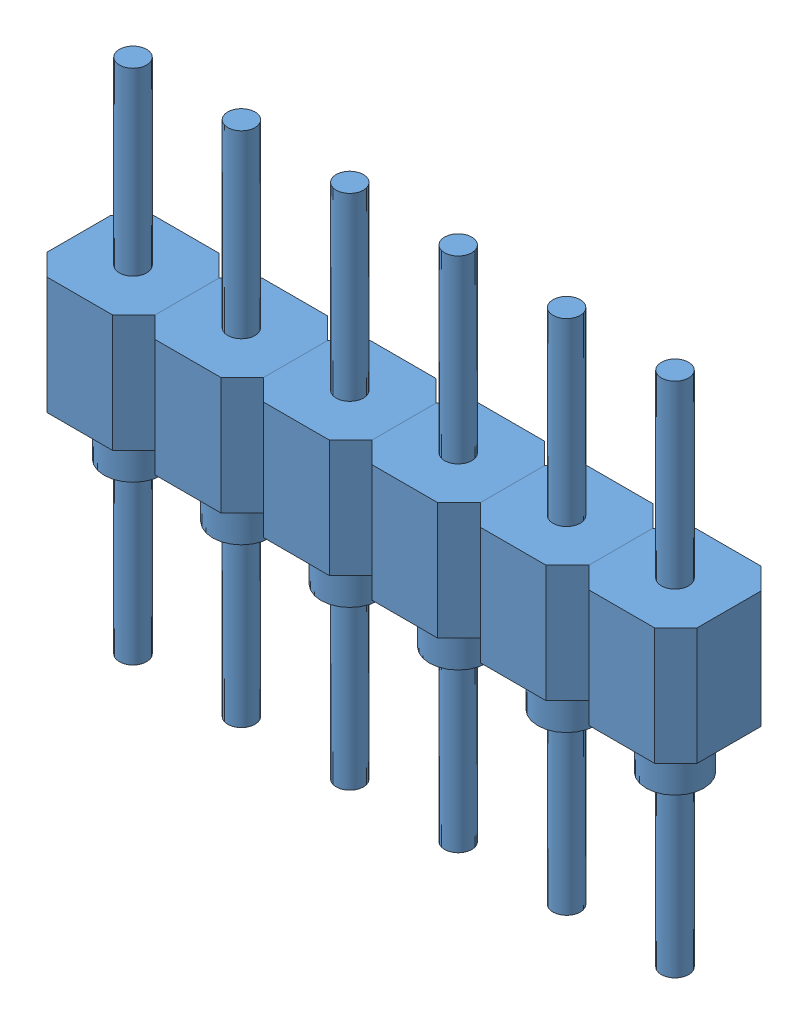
SolidWorks assembly Assemblage4.sldasm, configuration Défaut (file format 4700). Lengths in mm.
Overall size (15.24 12.11 2.5).
6 component instances, 1 part files, 0 mates.
Components (placement in the parent):
- Barette tulipe male_male par 1-1: Barette tulipe male_male par 1.SLDPRT [Défaut] at (-3.0988 -1.0444 0) size (2.54 12.11 2.5)
- Barette tulipe male_male par 1-2: Barette tulipe male_male par 1.SLDPRT [Défaut] at (-0.5588 -1.0444 0) size (2.54 12.11 2.5)
- Barette tulipe male_male par 1-3: Barette tulipe male_male par 1.SLDPRT [Défaut] at (1.9812 -1.0444 0) size (2.54 12.11 2.5)
- Barette tulipe male_male par 1-4: Barette tulipe male_male par 1.SLDPRT [Défaut] at (4.5212 -1.0444 0) size (2.54 12.11 2.5)
- Barette tulipe male_male par 1-5: Barette tulipe male_male par 1.SLDPRT [Défaut] at (7.0612 -1.0444 0) size (2.54 12.11 2.5)
- Barette tulipe male_male par 1-6: Barette tulipe male_male par 1.SLDPRT [Défaut] at (9.6012 -1.0444 0) size (2.54 12.11 2.5)
